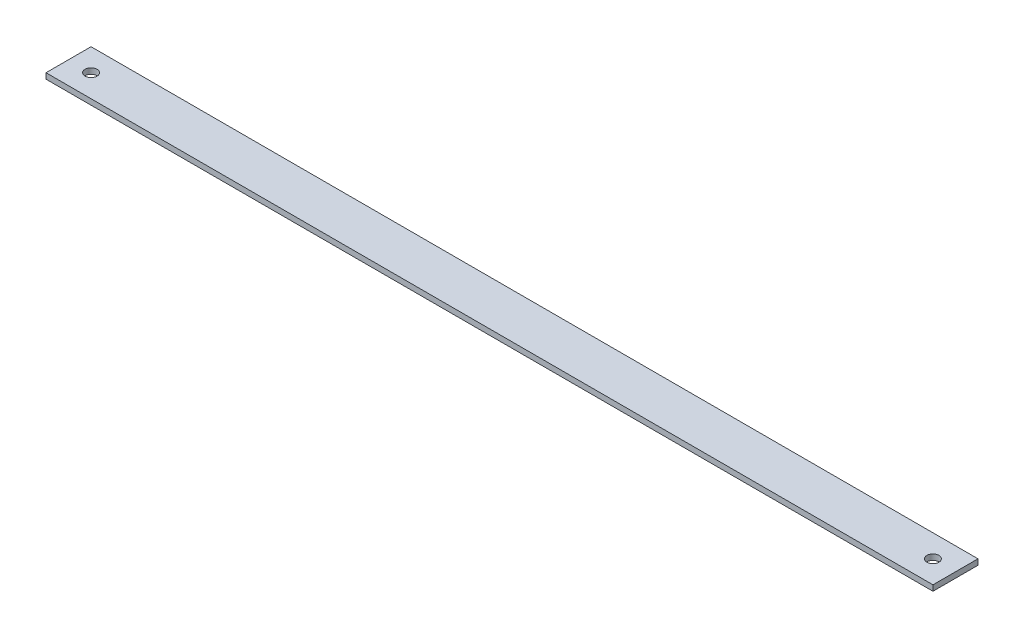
from build123d import *

# Parameters (mm, degrees)
SKETCH1_W           = 500.126
SKETCH1_H           = 25.4
BOSS_EXTRUDE1_DEPTH = 3.175
SKETCH3_R           = 3.3782
CUT_EXTRUDE1_DEPTH  = 251.405420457


with BuildPart() as part:
    # Sketch1 → Boss-Extrude1 (new body)
    with BuildSketch(Plane(origin=(0, 0, 0), x_dir=(1, 0, 0), z_dir=(0, 1, 0))):
        Rectangle(SKETCH1_W, SKETCH1_H)
    extrude(amount=BOSS_EXTRUDE1_DEPTH)

    # Sketch3 → Cut-Extrude1 (cut, through all)
    with BuildSketch(Plane(origin=(0, 3.175, 0), x_dir=(1, 0, 0), z_dir=(0, 1, 0))):
        with Locations(Location((-237.363, 0, 0), (0, 0, 270))):
            Circle(SKETCH3_R)
        with Locations(Location((237.363, 0, 0), (0, 0, 270))):
            Circle(SKETCH3_R)
    extrude(amount=-CUT_EXTRUDE1_DEPTH, mode=Mode.SUBTRACT)


solid = part.part
